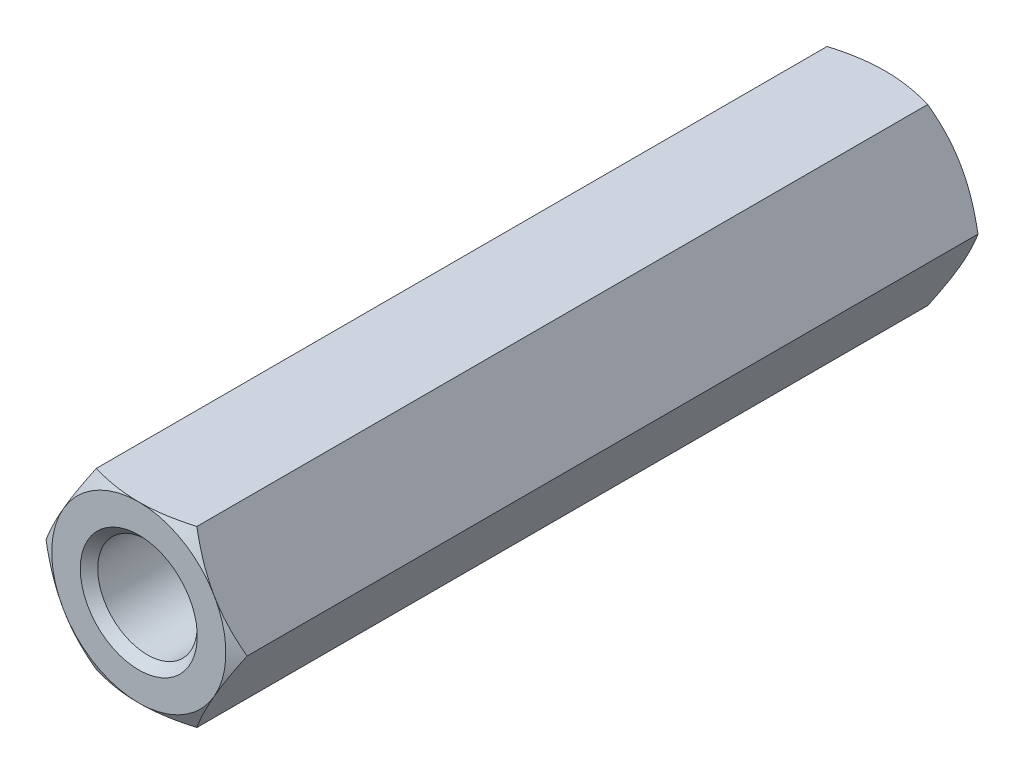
ISO-10303-21;
HEADER;
FILE_DESCRIPTION(('STEP AP214'),'2;1');
FILE_NAME('part.step','',(''),(''),'','','');
FILE_SCHEMA(('AUTOMOTIVE_DESIGN { 1 0 10303 214 1 1 1 1 }'));
ENDSEC;
DATA;
#1=APPLICATION_CONTEXT('core data for automotive mechanical design processes');
#2=APPLICATION_PROTOCOL_DEFINITION('international standard','automotive_design',2000,#1);
#3=PRODUCT_CONTEXT('',#1,'mechanical');
#4=PRODUCT('Part','Part','',(#3));
#5=PRODUCT_RELATED_PRODUCT_CATEGORY('part','',(#4));
#6=PRODUCT_DEFINITION_FORMATION('','',#4);
#7=PRODUCT_DEFINITION_CONTEXT('part definition',#1,'design');
#8=PRODUCT_DEFINITION('design','',#6,#7);
#9=PRODUCT_DEFINITION_SHAPE('','',#8);
#10=(LENGTH_UNIT() NAMED_UNIT(*) SI_UNIT(.MILLI.,.METRE.));
#11=(NAMED_UNIT(*) PLANE_ANGLE_UNIT() SI_UNIT($,.RADIAN.));
#12=(NAMED_UNIT(*) SI_UNIT($,.STERADIAN.) SOLID_ANGLE_UNIT());
#13=UNCERTAINTY_MEASURE_WITH_UNIT(LENGTH_MEASURE(1.E-05),#10,'distance_accuracy_value','');
#14=(GEOMETRIC_REPRESENTATION_CONTEXT(3) GLOBAL_UNCERTAINTY_ASSIGNED_CONTEXT((#13)) GLOBAL_UNIT_ASSIGNED_CONTEXT((#10,
#11,#12)) REPRESENTATION_CONTEXT('',''));
#15=CARTESIAN_POINT('',(0.,0.,0.));
#16=DIRECTION('',(0.,0.,1.));
#17=DIRECTION('',(1.,0.,0.));
#18=AXIS2_PLACEMENT_3D('',#15,#16,#17);
#19=CARTESIAN_POINT('',(4.04145188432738,0.,-15.));
#20=DIRECTION('',(0.866025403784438,0.5,0.));
#21=DIRECTION('',(-0.5,0.866025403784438,0.));
#22=AXIS2_PLACEMENT_3D('',#19,#20,#21);
#23=PLANE('',#22);
#24=CARTESIAN_POINT('',(4.04156735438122,-0.00019999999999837,14.6873259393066));
#25=CARTESIAN_POINT('',(3.9527667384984,0.153607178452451,14.73861421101));
#26=CARTESIAN_POINT('',(3.86319960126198,0.308742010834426,14.7852590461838));
#27=CARTESIAN_POINT('',(3.68251437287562,0.621698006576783,14.8666781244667));
#28=CARTESIAN_POINT('',(3.59139307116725,0.779524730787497,14.9014235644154));
#29=CARTESIAN_POINT('',(3.41027974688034,1.09322221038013,14.9555099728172));
#30=CARTESIAN_POINT('',(3.32031559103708,1.24904469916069,14.9752109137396));
#31=CARTESIAN_POINT('',(3.13996396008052,1.56142288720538,14.9987298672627));
#32=CARTESIAN_POINT('',(3.04957714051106,1.71797745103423,15.0025673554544));
#33=CARTESIAN_POINT('',(2.88068384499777,2.01050921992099,14.994584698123));
#34=CARTESIAN_POINT('',(2.80215208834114,2.14653021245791,14.9847245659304));
#35=CARTESIAN_POINT('',(2.64560020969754,2.417686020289,14.9534735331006));
#36=CARTESIAN_POINT('',(2.5675806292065,2.55281989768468,14.9320719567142));
#37=CARTESIAN_POINT('',(2.41070596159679,2.82453479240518,14.8785695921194));
#38=CARTESIAN_POINT('',(2.33187072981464,2.96108141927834,14.8462420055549));
#39=CARTESIAN_POINT('',(2.17537608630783,3.2321380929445,14.772871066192));
#40=CARTESIAN_POINT('',(2.09771466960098,3.36665161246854,14.7318449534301));
#41=CARTESIAN_POINT('',(2.02061047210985,3.5002,14.6873259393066));
#42=B_SPLINE_CURVE_WITH_KNOTS('',3,(#24,#25,#26,#27,#28,#29,#30,#31,#32,#33,#34,#35,#36,#37,#38,
#39,#40,#41),.UNSPECIFIED.,.F.,.F.,(4,2,2,2,2,2,2,2,4),(0.,0.554793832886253,1.11092123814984,
1.65328467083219,2.19498204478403,2.6666513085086,3.13875761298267,3.62133612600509,
4.10296698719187),.UNSPECIFIED.);
#43=CARTESIAN_POINT('',(4.04145188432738,0.,14.6873926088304));
#44=VERTEX_POINT('',#43);
#45=CARTESIAN_POINT('',(3.03108891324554,1.75,15.));
#46=VERTEX_POINT('',#45);
#47=EDGE_CURVE('E159',#44,#46,#42,.T.);
#48=ORIENTED_EDGE('',*,*,#47,.F.);
#49=DIRECTION('',(0.,0.,1.));
#50=VECTOR('',#49,1.);
#51=CARTESIAN_POINT('',(4.04145188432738,0.,-15.));
#52=LINE('',#51,#50);
#53=CARTESIAN_POINT('',(4.04145188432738,0.,-14.6873926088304));
#54=VERTEX_POINT('',#53);
#55=EDGE_CURVE('E293',#54,#44,#52,.T.);
#56=ORIENTED_EDGE('',*,*,#55,.F.);
#57=CARTESIAN_POINT('',(4.04156735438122,-0.00019999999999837,-14.6873259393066));
#58=CARTESIAN_POINT('',(3.9527667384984,0.153607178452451,-14.73861421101));
#59=CARTESIAN_POINT('',(3.86319960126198,0.308742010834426,-14.7852590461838));
#60=CARTESIAN_POINT('',(3.68251437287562,0.621698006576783,-14.8666781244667));
#61=CARTESIAN_POINT('',(3.59139307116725,0.779524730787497,-14.9014235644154));
#62=CARTESIAN_POINT('',(3.41027974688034,1.09322221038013,-14.9555099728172));
#63=CARTESIAN_POINT('',(3.32031559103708,1.24904469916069,-14.9752109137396));
#64=CARTESIAN_POINT('',(3.13996396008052,1.56142288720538,-14.9987298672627));
#65=CARTESIAN_POINT('',(3.04957714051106,1.71797745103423,-15.0025673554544));
#66=CARTESIAN_POINT('',(2.88068384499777,2.01050921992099,-14.994584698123));
#67=CARTESIAN_POINT('',(2.80215208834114,2.14653021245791,-14.9847245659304));
#68=CARTESIAN_POINT('',(2.64560020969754,2.417686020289,-14.9534735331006));
#69=CARTESIAN_POINT('',(2.5675806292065,2.55281989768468,-14.9320719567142));
#70=CARTESIAN_POINT('',(2.41070596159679,2.82453479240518,-14.8785695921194));
#71=CARTESIAN_POINT('',(2.33187072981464,2.96108141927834,-14.8462420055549));
#72=CARTESIAN_POINT('',(2.17537608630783,3.2321380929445,-14.772871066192));
#73=CARTESIAN_POINT('',(2.09771466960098,3.36665161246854,-14.7318449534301));
#74=CARTESIAN_POINT('',(2.02061047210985,3.5002,-14.6873259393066));
#75=B_SPLINE_CURVE_WITH_KNOTS('',3,(#57,#58,#59,#60,#61,#62,#63,#64,#65,#66,#67,#68,#69,#70,#71,
#72,#73,#74),.UNSPECIFIED.,.F.,.F.,(4,2,2,2,2,2,2,2,4),(0.,0.554793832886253,1.11092123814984,
1.65328467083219,2.19498204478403,2.6666513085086,3.13875761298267,3.62133612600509,
4.10296698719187),.UNSPECIFIED.);
#76=CARTESIAN_POINT('',(3.03108891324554,1.75,-15.));
#77=VERTEX_POINT('',#76);
#78=EDGE_CURVE('E284',#54,#77,#75,.T.);
#79=ORIENTED_EDGE('',*,*,#78,.T.);
#80=CARTESIAN_POINT('',(2.02072594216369,3.5,-14.6873926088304));
#81=VERTEX_POINT('',#80);
#82=EDGE_CURVE('E235',#77,#81,#75,.T.);
#83=ORIENTED_EDGE('',*,*,#82,.T.);
#84=DIRECTION('',(0.,0.,1.));
#85=VECTOR('',#84,1.);
#86=CARTESIAN_POINT('',(2.02072594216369,3.5,-15.));
#87=LINE('',#86,#85);
#88=CARTESIAN_POINT('',(2.02072594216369,3.5,14.6873926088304));
#89=VERTEX_POINT('',#88);
#90=EDGE_CURVE('E317',#81,#89,#87,.T.);
#91=ORIENTED_EDGE('',*,*,#90,.T.);
#92=EDGE_CURVE('E138',#46,#89,#42,.T.);
#93=ORIENTED_EDGE('',*,*,#92,.F.);
#94=EDGE_LOOP('',(#48,#56,#79,#83,#91,#93));
#95=FACE_BOUND('',#94,.T.);
#96=ADVANCED_FACE('F34',(#95),#23,.T.);
#97=CARTESIAN_POINT('',(2.02072594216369,-3.5,-15.));
#98=DIRECTION('',(0.866025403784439,-0.5,0.));
#99=DIRECTION('',(0.5,0.866025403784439,0.));
#100=AXIS2_PLACEMENT_3D('',#97,#98,#99);
#101=PLANE('',#100);
#102=CARTESIAN_POINT('',(2.02061047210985,-3.5002,14.6873259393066));
#103=CARTESIAN_POINT('',(2.10941108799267,-3.34639282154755,14.73861421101));
#104=CARTESIAN_POINT('',(2.19897822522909,-3.19125798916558,14.7852590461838));
#105=CARTESIAN_POINT('',(2.37966345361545,-2.87830199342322,14.8666781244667));
#106=CARTESIAN_POINT('',(2.47078475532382,-2.7204752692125,14.9014235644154));
#107=CARTESIAN_POINT('',(2.65189807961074,-2.40677778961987,14.9555099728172));
#108=CARTESIAN_POINT('',(2.74186223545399,-2.25095530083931,14.9752109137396));
#109=CARTESIAN_POINT('',(2.92221386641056,-1.93857711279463,14.9987298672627));
#110=CARTESIAN_POINT('',(3.01260068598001,-1.78202254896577,15.0025673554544));
#111=CARTESIAN_POINT('',(3.1814939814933,-1.48949078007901,14.994584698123));
#112=CARTESIAN_POINT('',(3.26002573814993,-1.35346978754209,14.9847245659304));
#113=CARTESIAN_POINT('',(3.41657761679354,-1.082313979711,14.9534735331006));
#114=CARTESIAN_POINT('',(3.49459719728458,-0.947180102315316,14.9320719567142));
#115=CARTESIAN_POINT('',(3.65147186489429,-0.675465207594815,14.8785695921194));
#116=CARTESIAN_POINT('',(3.73030709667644,-0.538918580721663,14.8462420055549));
#117=CARTESIAN_POINT('',(3.88680174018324,-0.267861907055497,14.772871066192));
#118=CARTESIAN_POINT('',(3.96446315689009,-0.133348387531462,14.7318449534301));
#119=CARTESIAN_POINT('',(4.04156735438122,0.0002000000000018,14.6873259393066));
#120=B_SPLINE_CURVE_WITH_KNOTS('',3,(#102,#103,#104,#105,#106,#107,#108,#109,#110,#111,#112,
#113,#114,#115,#116,#117,#118,#119),.UNSPECIFIED.,.F.,.F.,(4,2,2,2,2,2,2,2,4),(0.,
0.554793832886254,1.11092123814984,1.65328467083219,2.19498204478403,2.6666513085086,
3.13875761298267,3.6213361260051,4.10296698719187),.UNSPECIFIED.);
#121=CARTESIAN_POINT('',(2.02072594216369,-3.5,14.6873926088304));
#122=VERTEX_POINT('',#121);
#123=CARTESIAN_POINT('',(3.03108891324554,-1.75,15.));
#124=VERTEX_POINT('',#123);
#125=EDGE_CURVE('E365',#122,#124,#120,.T.);
#126=ORIENTED_EDGE('',*,*,#125,.F.);
#127=DIRECTION('',(0.,0.,1.));
#128=VECTOR('',#127,1.);
#129=CARTESIAN_POINT('',(2.02072594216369,-3.5,-15.));
#130=LINE('',#129,#128);
#131=CARTESIAN_POINT('',(2.02072594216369,-3.5,-14.6873926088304));
#132=VERTEX_POINT('',#131);
#133=EDGE_CURVE('E367',#132,#122,#130,.T.);
#134=ORIENTED_EDGE('',*,*,#133,.F.);
#135=CARTESIAN_POINT('',(2.02061047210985,-3.5002,-14.6873259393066));
#136=CARTESIAN_POINT('',(2.10941108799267,-3.34639282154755,-14.73861421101));
#137=CARTESIAN_POINT('',(2.19897822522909,-3.19125798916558,-14.7852590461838));
#138=CARTESIAN_POINT('',(2.37966345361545,-2.87830199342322,-14.8666781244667));
#139=CARTESIAN_POINT('',(2.47078475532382,-2.7204752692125,-14.9014235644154));
#140=CARTESIAN_POINT('',(2.65189807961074,-2.40677778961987,-14.9555099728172));
#141=CARTESIAN_POINT('',(2.74186223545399,-2.25095530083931,-14.9752109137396));
#142=CARTESIAN_POINT('',(2.92221386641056,-1.93857711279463,-14.9987298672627));
#143=CARTESIAN_POINT('',(3.01260068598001,-1.78202254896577,-15.0025673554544));
#144=CARTESIAN_POINT('',(3.1814939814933,-1.48949078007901,-14.994584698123));
#145=CARTESIAN_POINT('',(3.26002573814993,-1.35346978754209,-14.9847245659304));
#146=CARTESIAN_POINT('',(3.41657761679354,-1.082313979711,-14.9534735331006));
#147=CARTESIAN_POINT('',(3.49459719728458,-0.947180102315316,-14.9320719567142));
#148=CARTESIAN_POINT('',(3.65147186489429,-0.675465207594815,-14.8785695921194));
#149=CARTESIAN_POINT('',(3.73030709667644,-0.538918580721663,-14.8462420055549));
#150=CARTESIAN_POINT('',(3.88680174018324,-0.267861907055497,-14.772871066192));
#151=CARTESIAN_POINT('',(3.96446315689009,-0.133348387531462,-14.7318449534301));
#152=CARTESIAN_POINT('',(4.04156735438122,0.0002000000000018,-14.6873259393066));
#153=B_SPLINE_CURVE_WITH_KNOTS('',3,(#135,#136,#137,#138,#139,#140,#141,#142,#143,#144,#145,
#146,#147,#148,#149,#150,#151,#152),.UNSPECIFIED.,.F.,.F.,(4,2,2,2,2,2,2,2,4),(0.,
0.554793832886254,1.11092123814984,1.65328467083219,2.19498204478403,2.6666513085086,
3.13875761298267,3.6213361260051,4.10296698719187),.UNSPECIFIED.);
#154=CARTESIAN_POINT('',(3.03108891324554,-1.75,-15.));
#155=VERTEX_POINT('',#154);
#156=EDGE_CURVE('E308',#132,#155,#153,.T.);
#157=ORIENTED_EDGE('',*,*,#156,.T.);
#158=EDGE_CURVE('E232',#155,#54,#153,.T.);
#159=ORIENTED_EDGE('',*,*,#158,.T.);
#160=ORIENTED_EDGE('',*,*,#55,.T.);
#161=EDGE_CURVE('E160',#124,#44,#120,.T.);
#162=ORIENTED_EDGE('',*,*,#161,.F.);
#163=EDGE_LOOP('',(#126,#134,#157,#159,#160,#162));
#164=FACE_BOUND('',#163,.T.);
#165=ADVANCED_FACE('F305',(#164),#101,.T.);
#166=CARTESIAN_POINT('',(-2.02072594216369,-3.5,-15.));
#167=DIRECTION('',(0.,-1.,0.));
#168=DIRECTION('',(1.,0.,0.));
#169=AXIS2_PLACEMENT_3D('',#166,#167,#168);
#170=PLANE('',#169);
#171=CARTESIAN_POINT('',(-24.0144010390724,-3.50000000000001,3.00952260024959));
#172=CARTESIAN_POINT('',(-23.5019774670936,-3.50000000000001,3.3022760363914));
#173=CARTESIAN_POINT('',(-22.9894717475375,-3.50000000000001,3.59488557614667));
#174=CARTESIAN_POINT('',(-21.9642551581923,-3.50000000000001,4.17974590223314));
#175=CARTESIAN_POINT('',(-21.451544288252,-3.50000000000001,4.47199668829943));
#176=CARTESIAN_POINT('',(-19.9129889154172,-3.50000000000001,5.34813508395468));
#177=CARTESIAN_POINT('',(-18.8867764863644,-3.50000000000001,5.93137738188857));
#178=CARTESIAN_POINT('',(-17.3463207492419,-3.50000000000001,6.8041501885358));
#179=CARTESIAN_POINT('',(-16.8326640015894,-3.50000000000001,7.09471587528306));
#180=CARTESIAN_POINT('',(-15.8048376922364,-3.50000000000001,7.67493868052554));
#181=CARTESIAN_POINT('',(-15.2906681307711,-3.50000000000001,7.96459579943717));
#182=CARTESIAN_POINT('',(-14.2616693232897,-3.5,8.54269277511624));
#183=CARTESIAN_POINT('',(-13.7468401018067,-3.5,8.83113267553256));
#184=CARTESIAN_POINT('',(-12.7162585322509,-3.5,9.406357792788));
#185=CARTESIAN_POINT('',(-12.2005061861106,-3.5,9.69314301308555));
#186=CARTESIAN_POINT('',(-11.1655889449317,-3.5,10.2655250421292));
#187=CARTESIAN_POINT('',(-10.6464187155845,-3.5,10.5511122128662));
#188=CARTESIAN_POINT('',(-9.60611844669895,-3.5,11.1187962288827));
#189=CARTESIAN_POINT('',(-9.08498827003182,-3.5,11.4008928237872));
#190=CARTESIAN_POINT('',(-8.30089317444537,-3.5,11.8199184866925));
#191=CARTESIAN_POINT('',(-8.03905112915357,-3.5,11.9589472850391));
#192=CARTESIAN_POINT('',(-7.5144024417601,-3.5,12.2351713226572));
#193=CARTESIAN_POINT('',(-7.25159580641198,-3.5,12.3723665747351));
#194=CARTESIAN_POINT('',(-6.72476823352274,-3.5,12.644327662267));
#195=CARTESIAN_POINT('',(-6.46074745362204,-3.5,12.7790938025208));
#196=CARTESIAN_POINT('',(-5.93106751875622,-3.5,13.0453619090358));
#197=CARTESIAN_POINT('',(-5.66540840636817,-3.5,13.1768639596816));
#198=CARTESIAN_POINT('',(-5.12712536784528,-3.5,13.4376375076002));
#199=CARTESIAN_POINT('',(-4.85446174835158,-3.5,13.5668273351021));
#200=CARTESIAN_POINT('',(-4.30593256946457,-3.5,13.8184789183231));
#201=CARTESIAN_POINT('',(-4.03006629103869,-3.5,13.9409391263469));
#202=CARTESIAN_POINT('',(-3.61288240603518,-3.5,14.1170497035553));
#203=CARTESIAN_POINT('',(-3.47317951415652,-3.5,14.1745193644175));
#204=CARTESIAN_POINT('',(-3.19250774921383,-3.5,14.2862698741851));
#205=CARTESIAN_POINT('',(-3.05153895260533,-3.5,14.3405509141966));
#206=CARTESIAN_POINT('',(-2.76815876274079,-3.5,14.4451459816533));
#207=CARTESIAN_POINT('',(-2.62574765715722,-3.5,14.4954607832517));
#208=CARTESIAN_POINT('',(-2.33928161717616,-3.5,14.5911444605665));
#209=CARTESIAN_POINT('',(-2.19522685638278,-3.5,14.6365138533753));
#210=CARTESIAN_POINT('',(-1.85681791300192,-3.5,14.7352735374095));
#211=CARTESIAN_POINT('',(-1.66175187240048,-3.5,14.7862728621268));
#212=CARTESIAN_POINT('',(-1.26837086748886,-3.5,14.8739455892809));
#213=CARTESIAN_POINT('',(-1.07005688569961,-3.5,14.9106232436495));
#214=CARTESIAN_POINT('',(-0.771524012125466,-3.5,14.9522334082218));
#215=CARTESIAN_POINT('',(-0.672219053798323,-3.5,14.963849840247));
#216=CARTESIAN_POINT('',(-0.473177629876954,-3.5,14.982404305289));
#217=CARTESIAN_POINT('',(-0.373441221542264,-3.5,14.9893429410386));
#218=CARTESIAN_POINT('',(-0.173751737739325,-3.5,14.998327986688));
#219=CARTESIAN_POINT('',(-0.0737986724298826,-3.5,15.0003746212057));
#220=CARTESIAN_POINT('',(0.126085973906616,-3.5,14.9995126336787));
#221=CARTESIAN_POINT('',(0.226017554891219,-3.5,14.9966040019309));
#222=CARTESIAN_POINT('',(0.425499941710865,-3.5,14.9859286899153));
#223=CARTESIAN_POINT('',(0.52505105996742,-3.5,14.9781678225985));
#224=CARTESIAN_POINT('',(0.723689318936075,-3.5,14.9580291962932));
#225=CARTESIAN_POINT('',(0.822776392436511,-3.5,14.9456507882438));
#226=CARTESIAN_POINT('',(1.11911457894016,-3.5,14.9020808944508));
#227=CARTESIAN_POINT('',(1.31544487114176,-3.5,14.8644546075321));
#228=CARTESIAN_POINT('',(1.60840867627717,-3.5,14.7974553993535));
#229=CARTESIAN_POINT('',(1.70628490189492,-3.5,14.7732168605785));
#230=CARTESIAN_POINT('',(1.90122897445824,-3.5,14.7216554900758));
#231=CARTESIAN_POINT('',(1.99829681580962,-3.5,14.6943326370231));
#232=CARTESIAN_POINT('',(2.19162035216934,-3.5,14.6370093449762));
#233=CARTESIAN_POINT('',(2.28787613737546,-3.5,14.6070092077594));
#234=CARTESIAN_POINT('',(2.47962532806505,-3.5,14.5446890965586));
#235=CARTESIAN_POINT('',(2.57511877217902,-3.5,14.5123692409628));
#236=CARTESIAN_POINT('',(2.89221812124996,-3.5,14.4013318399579));
#237=CARTESIAN_POINT('',(3.11227583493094,-3.5,14.3181871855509));
#238=CARTESIAN_POINT('',(3.54935112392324,-3.5,14.1442183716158));
#239=CARTESIAN_POINT('',(3.76636785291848,-3.5,14.0533921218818));
#240=CARTESIAN_POINT('',(4.19818544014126,-3.5,13.8661289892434));
#241=CARTESIAN_POINT('',(4.41298414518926,-3.5,13.7696871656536));
#242=CARTESIAN_POINT('',(4.84067925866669,-3.5,13.5727526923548));
#243=CARTESIAN_POINT('',(5.05357586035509,-3.5,13.4722604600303));
#244=CARTESIAN_POINT('',(5.47844229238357,-3.5,13.2679722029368));
#245=CARTESIAN_POINT('',(5.69040837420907,-3.5,13.1641684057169));
#246=CARTESIAN_POINT('',(6.11318158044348,-3.5,12.954221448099));
#247=CARTESIAN_POINT('',(6.32398868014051,-3.5,12.8480782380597));
#248=CARTESIAN_POINT('',(6.74456880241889,-3.5,12.6340279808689));
#249=CARTESIAN_POINT('',(6.95434229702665,-3.5,12.5261218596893));
#250=CARTESIAN_POINT('',(7.37314220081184,-3.5,12.3088683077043));
#251=CARTESIAN_POINT('',(7.58216860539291,-3.5,12.1995208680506));
#252=CARTESIAN_POINT('',(8.20902498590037,-3.5,11.8693980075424));
#253=CARTESIAN_POINT('',(8.62594454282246,-3.5,11.6468945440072));
#254=CARTESIAN_POINT('',(9.45817666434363,-3.5,11.1987926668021));
#255=CARTESIAN_POINT('',(9.87348902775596,-3.5,10.9731938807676));
#256=CARTESIAN_POINT('',(10.7023110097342,-3.5,10.5201698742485));
#257=CARTESIAN_POINT('',(11.1158223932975,-3.5,10.2927478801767));
#258=CARTESIAN_POINT('',(11.9419778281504,-3.5,9.83633359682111));
#259=CARTESIAN_POINT('',(12.3546218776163,-3.5,9.60734130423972));
#260=CARTESIAN_POINT('',(13.2390358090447,-3.5,9.11489542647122));
#261=CARTESIAN_POINT('',(13.7107038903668,-3.5,8.85125909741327));
#262=CARTESIAN_POINT('',(14.6534040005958,-3.5,8.32284151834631));
#263=CARTESIAN_POINT('',(15.1244360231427,-3.5,8.05806025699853));
#264=CARTESIAN_POINT('',(16.5372790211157,-3.5,7.26216349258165));
#265=CARTESIAN_POINT('',(17.4783638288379,-3.5,6.72975925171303));
#266=CARTESIAN_POINT('',(19.3526150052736,-3.49999999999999,5.66667015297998));
#267=CARTESIAN_POINT('',(20.2857898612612,-3.49999999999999,5.13600023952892));
#268=CARTESIAN_POINT('',(21.6847186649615,-3.49999999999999,4.33909452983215));
#269=CARTESIAN_POINT('',(22.1507686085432,-3.49999999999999,4.07337817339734));
#270=CARTESIAN_POINT('',(23.0827018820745,-3.49999999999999,3.54165477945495));
#271=CARTESIAN_POINT('',(23.5485852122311,-3.49999999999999,3.27564774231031));
#272=CARTESIAN_POINT('',(24.0144010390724,-3.49999999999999,3.0095226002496));
#273=B_SPLINE_CURVE_WITH_KNOTS('',3,(#171,#172,#173,#174,#175,#176,#177,#178,#179,#180,#181,
#182,#183,#184,#185,#186,#187,#188,#189,#190,#191,#192,#193,#194,#195,#196,#197,#198,#199,#200,
#201,#202,#203,#204,#205,#206,#207,#208,#209,#210,#211,#212,#213,#214,#215,#216,#217,#218,#219,
#220,#221,#222,#223,#224,#225,#226,#227,#228,#229,#230,#231,#232,#233,#234,#235,#236,#237,#238,
#239,#240,#241,#242,#243,#244,#245,#246,#247,#248,#249,#250,#251,#252,#253,#254,#255,#256,#257,
#258,#259,#260,#261,#262,#263,#264,#265,#266,#267,#268,#269,#270,#271,#272),.UNSPECIFIED.,.F.,
.F.,(4,2,2,2,2,2,2,2,2,2,2,2,2,2,2,2,2,2,2,2,2,2,2,2,2,2,2,2,2,2,2,2,2,2,2,2,2,2,2,2,2,2,2,2,2,
2,2,2,2,2,4),(0.,1.77046373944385,3.5409287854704,7.08204837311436,8.85248413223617,
10.6229190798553,12.3932899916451,14.1636572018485,15.9412552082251,17.7189799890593,
18.6083635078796,19.4977408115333,20.3870057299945,21.2762476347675,22.181356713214,
23.0866730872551,23.5398284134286,23.9929565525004,24.4459960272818,24.8989880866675,
25.5034565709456,26.1077454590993,26.4075978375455,26.7074115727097,27.0072115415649,
27.3070120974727,27.6064541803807,27.9059383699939,28.5049001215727,28.8073671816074,
29.1098363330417,29.412271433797,29.714691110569,30.420177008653,31.1258554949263,
31.8321645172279,32.5384009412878,33.2464385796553,33.9544912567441,34.6621832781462,
35.3698796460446,36.7875902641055,38.2054729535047,39.6212406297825,41.0370112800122,
42.6580500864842,44.2791049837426,47.5228404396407,50.7433720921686,52.3528034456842,
53.962232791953),.UNSPECIFIED.);
#274=CARTESIAN_POINT('',(-2.02072594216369,-3.5,14.6873926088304));
#275=VERTEX_POINT('',#274);
#276=CARTESIAN_POINT('',(0.,-3.5,15.));
#277=VERTEX_POINT('',#276);
#278=EDGE_CURVE('E360',#275,#277,#273,.T.);
#279=ORIENTED_EDGE('',*,*,#278,.F.);
#280=DIRECTION('',(0.,0.,1.));
#281=VECTOR('',#280,1.);
#282=CARTESIAN_POINT('',(-2.02072594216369,-3.5,-15.));
#283=LINE('',#282,#281);
#284=CARTESIAN_POINT('',(-2.02072594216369,-3.5,-14.6873926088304));
#285=VERTEX_POINT('',#284);
#286=EDGE_CURVE('E368',#285,#275,#283,.T.);
#287=ORIENTED_EDGE('',*,*,#286,.F.);
#288=CARTESIAN_POINT('',(-13.93909338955,-3.50000000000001,-8.72316958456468));
#289=CARTESIAN_POINT('',(-13.6340370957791,-3.50000000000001,-8.8939836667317));
#290=CARTESIAN_POINT('',(-13.328844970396,-3.5,-9.06455582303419));
#291=CARTESIAN_POINT('',(-12.7181143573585,-3.5,-9.40508295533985));
#292=CARTESIAN_POINT('',(-12.412575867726,-3.5,-9.57503792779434));
#293=CARTESIAN_POINT('',(-11.8010010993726,-3.5,-9.91423989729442));
#294=CARTESIAN_POINT('',(-11.4949647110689,-3.5,-10.0834866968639));
#295=CARTESIAN_POINT('',(-10.8823730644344,-3.5,-10.4210373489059));
#296=CARTESIAN_POINT('',(-10.5758178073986,-3.5,-10.589341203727));
#297=CARTESIAN_POINT('',(-9.96272869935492,-3.5,-10.9243828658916));
#298=CARTESIAN_POINT('',(-9.65619628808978,-3.5,-11.0911233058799));
#299=CARTESIAN_POINT('',(-9.04229742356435,-3.5,-11.4230613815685));
#300=CARTESIAN_POINT('',(-8.73493097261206,-3.5,-11.5882590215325));
#301=CARTESIAN_POINT('',(-8.11914738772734,-3.5,-11.9165906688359));
#302=CARTESIAN_POINT('',(-7.8107303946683,-3.5,-12.079724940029));
#303=CARTESIAN_POINT('',(-7.19244579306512,-3.5,-12.4032177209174));
#304=CARTESIAN_POINT('',(-6.88257820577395,-3.5,-12.5635762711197));
#305=CARTESIAN_POINT('',(-6.26306488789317,-3.5,-12.8792724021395));
#306=CARTESIAN_POINT('',(-5.95343325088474,-3.5,-13.0346375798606));
#307=CARTESIAN_POINT('',(-5.33137168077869,-3.5,-13.3398544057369));
#308=CARTESIAN_POINT('',(-5.01894126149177,-3.5,-13.489705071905));
#309=CARTESIAN_POINT('',(-4.54653144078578,-3.5,-13.7085181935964));
#310=CARTESIAN_POINT('',(-4.38801795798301,-3.5,-13.7806413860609));
#311=CARTESIAN_POINT('',(-4.06979128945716,-3.5,-13.92218453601));
#312=CARTESIAN_POINT('',(-3.91007814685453,-3.5,-13.9916045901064));
#313=CARTESIAN_POINT('',(-3.58923189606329,-3.5,-14.1270199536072));
#314=CARTESIAN_POINT('',(-3.42809904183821,-3.5,-14.1930158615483));
#315=CARTESIAN_POINT('',(-3.10411792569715,-3.5,-14.3206318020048));
#316=CARTESIAN_POINT('',(-2.94126979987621,-3.5,-14.3822521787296));
#317=CARTESIAN_POINT('',(-2.57330185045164,-3.5,-14.5143159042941));
#318=CARTESIAN_POINT('',(-2.36761759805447,-3.5,-14.5832123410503));
#319=CARTESIAN_POINT('',(-1.95256058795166,-3.5,-14.7090662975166));
#320=CARTESIAN_POINT('',(-1.74318771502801,-3.5,-14.7660234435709));
#321=CARTESIAN_POINT('',(-1.32302041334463,-3.5,-14.8632625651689));
#322=CARTESIAN_POINT('',(-1.11227086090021,-3.5,-14.9037308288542));
#323=CARTESIAN_POINT('',(-0.794049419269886,-3.5,-14.9495004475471));
#324=CARTESIAN_POINT('',(-0.687633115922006,-3.5,-14.9622678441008));
#325=CARTESIAN_POINT('',(-0.47429919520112,-3.5,-14.9824338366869));
#326=CARTESIAN_POINT('',(-0.367381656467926,-3.5,-14.9898332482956));
#327=CARTESIAN_POINT('',(-0.151941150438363,-3.5,-14.9990600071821));
#328=CARTESIAN_POINT('',(-0.0434150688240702,-3.5,-15.0008152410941));
#329=CARTESIAN_POINT('',(0.173574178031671,-3.5,-14.9984861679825));
#330=CARTESIAN_POINT('',(0.282037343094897,-3.5,-14.9944018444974));
#331=CARTESIAN_POINT('',(0.498618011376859,-3.5,-14.980543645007));
#332=CARTESIAN_POINT('',(0.606735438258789,-3.5,-14.9707685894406));
#333=CARTESIAN_POINT('',(0.822348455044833,-3.5,-14.9458689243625));
#334=CARTESIAN_POINT('',(0.929844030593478,-3.5,-14.9307441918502));
#335=CARTESIAN_POINT('',(1.14527612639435,-3.5,-14.8954132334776));
#336=CARTESIAN_POINT('',(1.25320318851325,-3.5,-14.8751498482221));
#337=CARTESIAN_POINT('',(1.46812360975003,-3.5,-14.8301893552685));
#338=CARTESIAN_POINT('',(1.57511695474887,-3.5,-14.8054921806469));
#339=CARTESIAN_POINT('',(1.78815137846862,-3.5,-14.7522271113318));
#340=CARTESIAN_POINT('',(1.89419226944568,-3.5,-14.7236584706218));
#341=CARTESIAN_POINT('',(2.10530694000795,-3.5,-14.6631901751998));
#342=CARTESIAN_POINT('',(2.21038077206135,-3.5,-14.6312907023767));
#343=CARTESIAN_POINT('',(2.51184829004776,-3.5,-14.5352775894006));
#344=CARTESIAN_POINT('',(2.70709295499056,-3.5,-14.4675545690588));
#345=CARTESIAN_POINT('',(3.09486410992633,-3.5,-14.3246844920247));
#346=CARTESIAN_POINT('',(3.28738980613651,-3.5,-14.2495353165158));
#347=CARTESIAN_POINT('',(3.67037650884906,-3.5,-14.0936562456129));
#348=CARTESIAN_POINT('',(3.86083529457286,-3.5,-14.0129209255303));
#349=CARTESIAN_POINT('',(4.23991407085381,-3.5,-13.8473190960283));
#350=CARTESIAN_POINT('',(4.42853424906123,-3.5,-13.7624530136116));
#351=CARTESIAN_POINT('',(4.80483432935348,-3.5,-13.589327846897));
#352=CARTESIAN_POINT('',(4.99251022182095,-3.5,-13.5010600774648));
#353=CARTESIAN_POINT('',(5.3666844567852,-3.5,-13.3220606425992));
#354=CARTESIAN_POINT('',(5.55318277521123,-3.5,-13.2313289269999));
#355=CARTESIAN_POINT('',(6.11104952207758,-3.5,-12.956362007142));
#356=CARTESIAN_POINT('',(6.48100139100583,-3.5,-12.7692560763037));
#357=CARTESIAN_POINT('',(7.21924313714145,-3.5,-12.3896905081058));
#358=CARTESIAN_POINT('',(7.58752697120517,-3.5,-12.1972191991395));
#359=CARTESIAN_POINT('',(8.32236027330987,-3.5,-11.8088866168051));
#360=CARTESIAN_POINT('',(8.6889095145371,-3.5,-11.6130249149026));
#361=CARTESIAN_POINT('',(9.42018483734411,-3.5,-11.2192150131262));
#362=CARTESIAN_POINT('',(9.78491281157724,-3.5,-11.0212703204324));
#363=CARTESIAN_POINT('',(10.5134214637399,-3.5,-10.6236447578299));
#364=CARTESIAN_POINT('',(10.8772021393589,-3.5,-10.4239638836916));
#365=CARTESIAN_POINT('',(11.4663032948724,-3.5,-10.099222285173));
#366=CARTESIAN_POINT('',(11.6918455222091,-3.5,-9.97456335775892));
#367=CARTESIAN_POINT('',(12.1427515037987,-3.5,-9.72478250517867));
#368=CARTESIAN_POINT('',(12.368115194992,-3.5,-9.59966046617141));
#369=CARTESIAN_POINT('',(12.8178779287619,-3.5,-9.34947273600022));
#370=CARTESIAN_POINT('',(13.0422776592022,-3.5,-9.22440828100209));
#371=CARTESIAN_POINT('',(13.4908410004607,-3.5,-8.9739969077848));
#372=CARTESIAN_POINT('',(13.7150046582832,-3.5,-8.84865007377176));
#373=CARTESIAN_POINT('',(13.93909338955,-3.5,-8.72316958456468));
#374=B_SPLINE_CURVE_WITH_KNOTS('',3,(#288,#289,#290,#291,#292,#293,#294,#295,#296,#297,#298,
#299,#300,#301,#302,#303,#304,#305,#306,#307,#308,#309,#310,#311,#312,#313,#314,#315,#316,#317,
#318,#319,#320,#321,#322,#323,#324,#325,#326,#327,#328,#329,#330,#331,#332,#333,#334,#335,#336,
#337,#338,#339,#340,#341,#342,#343,#344,#345,#346,#347,#348,#349,#350,#351,#352,#353,#354,#355,
#356,#357,#358,#359,#360,#361,#362,#363,#364,#365,#366,#367,#368,#369,#370,#371,#372,#373),
.UNSPECIFIED.,.F.,.F.,(4,2,2,2,2,2,2,2,2,2,2,2,2,2,2,2,2,2,2,2,2,2,2,2,2,2,2,2,2,2,2,2,2,2,2,2,
2,2,2,2,2,2,4),(0.,1.04887173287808,2.09774948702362,3.14690246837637,4.19605283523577,
5.24289261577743,6.2897295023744,7.33643114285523,8.383117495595,9.4223602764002,
10.4617872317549,10.9842185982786,11.5066312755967,12.0289523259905,12.551232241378,
13.2017093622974,13.8522068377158,14.4951364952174,14.8165592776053,15.1379332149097,
15.4633972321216,15.788862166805,16.1143945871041,16.4399344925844,16.7692678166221,
17.0986061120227,17.4280079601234,17.7573918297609,18.3771299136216,18.9970453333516,
19.6175714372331,20.2380335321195,20.8602010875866,21.4823813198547,22.726041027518,
23.9726577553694,25.2194332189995,26.464368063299,27.7093059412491,28.4824046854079,
29.2557081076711,30.0264005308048,30.7968874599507),.UNSPECIFIED.);
#375=CARTESIAN_POINT('',(0.,-3.5,-15.));
#376=VERTEX_POINT('',#375);
#377=EDGE_CURVE('E313',#285,#376,#374,.T.);
#378=ORIENTED_EDGE('',*,*,#377,.T.);
#379=EDGE_CURVE('E260',#376,#132,#374,.T.);
#380=ORIENTED_EDGE('',*,*,#379,.T.);
#381=ORIENTED_EDGE('',*,*,#133,.T.);
#382=EDGE_CURVE('E195',#277,#122,#273,.T.);
#383=ORIENTED_EDGE('',*,*,#382,.F.);
#384=EDGE_LOOP('',(#279,#287,#378,#380,#381,#383));
#385=FACE_BOUND('',#384,.T.);
#386=ADVANCED_FACE('F218',(#385),#170,.T.);
#387=CARTESIAN_POINT('',(-4.04145188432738,0.,-15.));
#388=DIRECTION('',(-0.866025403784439,-0.5,0.));
#389=DIRECTION('',(0.5,-0.866025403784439,0.));
#390=AXIS2_PLACEMENT_3D('',#387,#388,#389);
#391=PLANE('',#390);
#392=CARTESIAN_POINT('',(-4.04156735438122,0.000199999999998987,14.6873259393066));
#393=CARTESIAN_POINT('',(-3.9527667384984,-0.153607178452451,14.73861421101));
#394=CARTESIAN_POINT('',(-3.86319960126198,-0.308742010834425,14.7852590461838));
#395=CARTESIAN_POINT('',(-3.68251437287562,-0.621698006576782,14.8666781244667));
#396=CARTESIAN_POINT('',(-3.59139307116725,-0.779524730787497,14.9014235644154));
#397=CARTESIAN_POINT('',(-3.41027974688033,-1.09322221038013,14.9555099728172));
#398=CARTESIAN_POINT('',(-3.32031559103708,-1.24904469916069,14.9752109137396));
#399=CARTESIAN_POINT('',(-3.13996396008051,-1.56142288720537,14.9987298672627));
#400=CARTESIAN_POINT('',(-3.04957714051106,-1.71797745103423,15.0025673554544));
#401=CARTESIAN_POINT('',(-2.88068384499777,-2.01050921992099,14.994584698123));
#402=CARTESIAN_POINT('',(-2.80215208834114,-2.14653021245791,14.9847245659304));
#403=CARTESIAN_POINT('',(-2.64560020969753,-2.41768602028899,14.9534735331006));
#404=CARTESIAN_POINT('',(-2.56758062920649,-2.55281989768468,14.9320719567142));
#405=CARTESIAN_POINT('',(-2.41070596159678,-2.82453479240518,14.8785695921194));
#406=CARTESIAN_POINT('',(-2.33187072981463,-2.96108141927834,14.8462420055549));
#407=CARTESIAN_POINT('',(-2.17537608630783,-3.2321380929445,14.772871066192));
#408=CARTESIAN_POINT('',(-2.09771466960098,-3.36665161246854,14.7318449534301));
#409=CARTESIAN_POINT('',(-2.02061047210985,-3.5002,14.6873259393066));
#410=B_SPLINE_CURVE_WITH_KNOTS('',3,(#392,#393,#394,#395,#396,#397,#398,#399,#400,#401,#402,
#403,#404,#405,#406,#407,#408,#409),.UNSPECIFIED.,.F.,.F.,(4,2,2,2,2,2,2,2,4),(0.,
0.554793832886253,1.11092123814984,1.65328467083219,2.19498204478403,2.6666513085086,
3.13875761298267,3.6213361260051,4.10296698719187),.UNSPECIFIED.);
#411=CARTESIAN_POINT('',(-4.04145188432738,0.,14.6873926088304));
#412=VERTEX_POINT('',#411);
#413=CARTESIAN_POINT('',(-3.03108891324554,-1.75,15.));
#414=VERTEX_POINT('',#413);
#415=EDGE_CURVE('E147',#412,#414,#410,.T.);
#416=ORIENTED_EDGE('',*,*,#415,.F.);
#417=DIRECTION('',(0.,0.,1.));
#418=VECTOR('',#417,1.);
#419=CARTESIAN_POINT('',(-4.04145188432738,0.,-15.));
#420=LINE('',#419,#418);
#421=CARTESIAN_POINT('',(-4.04145188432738,0.,-14.6873926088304));
#422=VERTEX_POINT('',#421);
#423=EDGE_CURVE('E158',#422,#412,#420,.T.);
#424=ORIENTED_EDGE('',*,*,#423,.F.);
#425=CARTESIAN_POINT('',(-4.04156735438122,0.000199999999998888,-14.6873259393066));
#426=CARTESIAN_POINT('',(-3.9527667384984,-0.15360717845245,-14.73861421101));
#427=CARTESIAN_POINT('',(-3.86319960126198,-0.308742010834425,-14.7852590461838));
#428=CARTESIAN_POINT('',(-3.68251437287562,-0.621698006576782,-14.8666781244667));
#429=CARTESIAN_POINT('',(-3.59139307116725,-0.779524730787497,-14.9014235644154));
#430=CARTESIAN_POINT('',(-3.41027974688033,-1.09322221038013,-14.9555099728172));
#431=CARTESIAN_POINT('',(-3.32031559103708,-1.24904469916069,-14.9752109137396));
#432=CARTESIAN_POINT('',(-3.13996396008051,-1.56142288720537,-14.9987298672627));
#433=CARTESIAN_POINT('',(-3.04957714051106,-1.71797745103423,-15.0025673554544));
#434=CARTESIAN_POINT('',(-2.88068384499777,-2.01050921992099,-14.994584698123));
#435=CARTESIAN_POINT('',(-2.80215208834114,-2.14653021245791,-14.9847245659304));
#436=CARTESIAN_POINT('',(-2.64560020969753,-2.417686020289,-14.9534735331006));
#437=CARTESIAN_POINT('',(-2.56758062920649,-2.55281989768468,-14.9320719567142));
#438=CARTESIAN_POINT('',(-2.41070596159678,-2.82453479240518,-14.8785695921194));
#439=CARTESIAN_POINT('',(-2.33187072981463,-2.96108141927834,-14.8462420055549));
#440=CARTESIAN_POINT('',(-2.17537608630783,-3.2321380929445,-14.772871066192));
#441=CARTESIAN_POINT('',(-2.09771466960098,-3.36665161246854,-14.7318449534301));
#442=CARTESIAN_POINT('',(-2.02061047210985,-3.5002,-14.6873259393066));
#443=B_SPLINE_CURVE_WITH_KNOTS('',3,(#425,#426,#427,#428,#429,#430,#431,#432,#433,#434,#435,
#436,#437,#438,#439,#440,#441,#442),.UNSPECIFIED.,.F.,.F.,(4,2,2,2,2,2,2,2,4),(0.,
0.554793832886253,1.11092123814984,1.65328467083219,2.19498204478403,2.6666513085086,
3.13875761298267,3.6213361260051,4.10296698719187),.UNSPECIFIED.);
#444=CARTESIAN_POINT('',(-3.03108891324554,-1.75,-15.));
#445=VERTEX_POINT('',#444);
#446=EDGE_CURVE('E223',#422,#445,#443,.T.);
#447=ORIENTED_EDGE('',*,*,#446,.T.);
#448=EDGE_CURVE('E234',#445,#285,#443,.T.);
#449=ORIENTED_EDGE('',*,*,#448,.T.);
#450=ORIENTED_EDGE('',*,*,#286,.T.);
#451=EDGE_CURVE('E162',#414,#275,#410,.T.);
#452=ORIENTED_EDGE('',*,*,#451,.F.);
#453=EDGE_LOOP('',(#416,#424,#447,#449,#450,#452));
#454=FACE_BOUND('',#453,.T.);
#455=ADVANCED_FACE('F215',(#454),#391,.T.);
#456=CARTESIAN_POINT('',(-2.02072594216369,3.5,-15.));
#457=DIRECTION('',(-0.866025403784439,0.5,0.));
#458=DIRECTION('',(-0.5,-0.866025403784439,0.));
#459=AXIS2_PLACEMENT_3D('',#456,#457,#458);
#460=PLANE('',#459);
#461=CARTESIAN_POINT('',(-2.02061047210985,3.5002,14.6873259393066));
#462=CARTESIAN_POINT('',(-2.10941108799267,3.34639282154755,14.73861421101));
#463=CARTESIAN_POINT('',(-2.19897822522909,3.19125798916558,14.7852590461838));
#464=CARTESIAN_POINT('',(-2.37966345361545,2.87830199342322,14.8666781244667));
#465=CARTESIAN_POINT('',(-2.47078475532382,2.7204752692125,14.9014235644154));
#466=CARTESIAN_POINT('',(-2.65189807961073,2.40677778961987,14.9555099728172));
#467=CARTESIAN_POINT('',(-2.74186223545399,2.25095530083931,14.9752109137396));
#468=CARTESIAN_POINT('',(-2.92221386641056,1.93857711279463,14.9987298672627));
#469=CARTESIAN_POINT('',(-3.01260068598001,1.78202254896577,15.0025673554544));
#470=CARTESIAN_POINT('',(-3.1814939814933,1.48949078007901,14.994584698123));
#471=CARTESIAN_POINT('',(-3.26002573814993,1.35346978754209,14.9847245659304));
#472=CARTESIAN_POINT('',(-3.41657761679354,1.08231397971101,14.9534735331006));
#473=CARTESIAN_POINT('',(-3.49459719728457,0.947180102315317,14.9320719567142));
#474=CARTESIAN_POINT('',(-3.65147186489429,0.675465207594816,14.8785695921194));
#475=CARTESIAN_POINT('',(-3.73030709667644,0.538918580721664,14.8462420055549));
#476=CARTESIAN_POINT('',(-3.88680174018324,0.267861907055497,14.772871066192));
#477=CARTESIAN_POINT('',(-3.96446315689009,0.133348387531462,14.7318449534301));
#478=CARTESIAN_POINT('',(-4.04156735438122,-0.000200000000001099,14.6873259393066));
#479=B_SPLINE_CURVE_WITH_KNOTS('',3,(#461,#462,#463,#464,#465,#466,#467,#468,#469,#470,#471,
#472,#473,#474,#475,#476,#477,#478),.UNSPECIFIED.,.F.,.F.,(4,2,2,2,2,2,2,2,4),(0.,
0.554793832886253,1.11092123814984,1.65328467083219,2.19498204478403,2.6666513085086,
3.13875761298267,3.62133612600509,4.10296698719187),.UNSPECIFIED.);
#480=CARTESIAN_POINT('',(-2.02072594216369,3.5,14.6873926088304));
#481=VERTEX_POINT('',#480);
#482=CARTESIAN_POINT('',(-3.03108891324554,1.75,15.));
#483=VERTEX_POINT('',#482);
#484=EDGE_CURVE('E127',#481,#483,#479,.T.);
#485=ORIENTED_EDGE('',*,*,#484,.F.);
#486=DIRECTION('',(0.,0.,1.));
#487=VECTOR('',#486,1.);
#488=CARTESIAN_POINT('',(-2.02072594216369,3.5,-15.));
#489=LINE('',#488,#487);
#490=CARTESIAN_POINT('',(-2.02072594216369,3.5,-14.6873926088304));
#491=VERTEX_POINT('',#490);
#492=EDGE_CURVE('E318',#491,#481,#489,.T.);
#493=ORIENTED_EDGE('',*,*,#492,.F.);
#494=CARTESIAN_POINT('',(-2.02061047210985,3.5002,-14.6873259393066));
#495=CARTESIAN_POINT('',(-2.10941108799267,3.34639282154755,-14.73861421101));
#496=CARTESIAN_POINT('',(-2.19897822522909,3.19125798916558,-14.7852590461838));
#497=CARTESIAN_POINT('',(-2.37966345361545,2.87830199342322,-14.8666781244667));
#498=CARTESIAN_POINT('',(-2.47078475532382,2.7204752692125,-14.9014235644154));
#499=CARTESIAN_POINT('',(-2.65189807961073,2.40677778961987,-14.9555099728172));
#500=CARTESIAN_POINT('',(-2.74186223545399,2.25095530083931,-14.9752109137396));
#501=CARTESIAN_POINT('',(-2.92221386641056,1.93857711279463,-14.9987298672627));
#502=CARTESIAN_POINT('',(-3.01260068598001,1.78202254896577,-15.0025673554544));
#503=CARTESIAN_POINT('',(-3.1814939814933,1.48949078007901,-14.994584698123));
#504=CARTESIAN_POINT('',(-3.26002573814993,1.35346978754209,-14.9847245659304));
#505=CARTESIAN_POINT('',(-3.41657761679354,1.08231397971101,-14.9534735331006));
#506=CARTESIAN_POINT('',(-3.49459719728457,0.947180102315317,-14.9320719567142));
#507=CARTESIAN_POINT('',(-3.65147186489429,0.675465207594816,-14.8785695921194));
#508=CARTESIAN_POINT('',(-3.73030709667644,0.538918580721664,-14.8462420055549));
#509=CARTESIAN_POINT('',(-3.88680174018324,0.267861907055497,-14.772871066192));
#510=CARTESIAN_POINT('',(-3.96446315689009,0.133348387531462,-14.7318449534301));
#511=CARTESIAN_POINT('',(-4.04156735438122,-0.000200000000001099,-14.6873259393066));
#512=B_SPLINE_CURVE_WITH_KNOTS('',3,(#494,#495,#496,#497,#498,#499,#500,#501,#502,#503,#504,
#505,#506,#507,#508,#509,#510,#511),.UNSPECIFIED.,.F.,.F.,(4,2,2,2,2,2,2,2,4),(0.,
0.554793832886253,1.11092123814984,1.65328467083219,2.19498204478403,2.6666513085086,
3.13875761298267,3.62133612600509,4.10296698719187),.UNSPECIFIED.);
#513=CARTESIAN_POINT('',(-3.03108891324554,1.75,-15.));
#514=VERTEX_POINT('',#513);
#515=EDGE_CURVE('E276',#491,#514,#512,.T.);
#516=ORIENTED_EDGE('',*,*,#515,.T.);
#517=EDGE_CURVE('E233',#514,#422,#512,.T.);
#518=ORIENTED_EDGE('',*,*,#517,.T.);
#519=ORIENTED_EDGE('',*,*,#423,.T.);
#520=EDGE_CURVE('E141',#483,#412,#479,.T.);
#521=ORIENTED_EDGE('',*,*,#520,.F.);
#522=EDGE_LOOP('',(#485,#493,#516,#518,#519,#521));
#523=FACE_BOUND('',#522,.T.);
#524=ADVANCED_FACE('F155',(#523),#460,.T.);
#525=CARTESIAN_POINT('',(2.02072594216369,3.5,-15.));
#526=DIRECTION('',(0.,1.,0.));
#527=DIRECTION('',(0.,0.,1.));
#528=AXIS2_PLACEMENT_3D('',#525,#526,#527);
#529=PLANE('',#528);
#530=CARTESIAN_POINT('',(24.0144010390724,3.5,3.00952260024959));
#531=CARTESIAN_POINT('',(23.5019774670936,3.5,3.3022760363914));
#532=CARTESIAN_POINT('',(22.9894717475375,3.5,3.59488557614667));
#533=CARTESIAN_POINT('',(21.9642551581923,3.5,4.17974590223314));
#534=CARTESIAN_POINT('',(21.4515442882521,3.5,4.47199668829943));
#535=CARTESIAN_POINT('',(19.9129889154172,3.5,5.34813508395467));
#536=CARTESIAN_POINT('',(18.8867764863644,3.5,5.93137738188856));
#537=CARTESIAN_POINT('',(17.3463207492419,3.5,6.80415018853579));
#538=CARTESIAN_POINT('',(16.8326640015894,3.5,7.09471587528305));
#539=CARTESIAN_POINT('',(15.8048376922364,3.5,7.67493868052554));
#540=CARTESIAN_POINT('',(15.2906681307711,3.5,7.96459579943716));
#541=CARTESIAN_POINT('',(14.2616693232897,3.5,8.54269277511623));
#542=CARTESIAN_POINT('',(13.7468401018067,3.5,8.83113267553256));
#543=CARTESIAN_POINT('',(12.7162585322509,3.5,9.40635779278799));
#544=CARTESIAN_POINT('',(12.2005061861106,3.5,9.69314301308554));
#545=CARTESIAN_POINT('',(11.1655889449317,3.5,10.2655250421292));
#546=CARTESIAN_POINT('',(10.6464187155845,3.5,10.5511122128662));
#547=CARTESIAN_POINT('',(9.60611844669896,3.5,11.1187962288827));
#548=CARTESIAN_POINT('',(9.08498827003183,3.5,11.4008928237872));
#549=CARTESIAN_POINT('',(8.30089317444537,3.5,11.8199184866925));
#550=CARTESIAN_POINT('',(8.03905112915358,3.5,11.9589472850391));
#551=CARTESIAN_POINT('',(7.51440244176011,3.5,12.2351713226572));
#552=CARTESIAN_POINT('',(7.25159580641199,3.5,12.3723665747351));
#553=CARTESIAN_POINT('',(6.72476823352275,3.5,12.644327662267));
#554=CARTESIAN_POINT('',(6.46074745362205,3.5,12.7790938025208));
#555=CARTESIAN_POINT('',(5.93106751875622,3.5,13.0453619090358));
#556=CARTESIAN_POINT('',(5.66540840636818,3.5,13.1768639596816));
#557=CARTESIAN_POINT('',(5.12712536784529,3.5,13.4376375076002));
#558=CARTESIAN_POINT('',(4.85446174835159,3.5,13.5668273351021));
#559=CARTESIAN_POINT('',(4.30593256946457,3.5,13.8184789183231));
#560=CARTESIAN_POINT('',(4.03006629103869,3.5,13.9409391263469));
#561=CARTESIAN_POINT('',(3.61288240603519,3.5,14.1170497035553));
#562=CARTESIAN_POINT('',(3.47317951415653,3.5,14.1745193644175));
#563=CARTESIAN_POINT('',(3.19250774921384,3.5,14.2862698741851));
#564=CARTESIAN_POINT('',(3.05153895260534,3.5,14.3405509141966));
#565=CARTESIAN_POINT('',(2.7681587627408,3.5,14.4451459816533));
#566=CARTESIAN_POINT('',(2.62574765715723,3.5,14.4954607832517));
#567=CARTESIAN_POINT('',(2.33928161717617,3.5,14.5911444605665));
#568=CARTESIAN_POINT('',(2.19522685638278,3.5,14.6365138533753));
#569=CARTESIAN_POINT('',(1.85681791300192,3.5,14.7352735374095));
#570=CARTESIAN_POINT('',(1.66175187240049,3.5,14.7862728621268));
#571=CARTESIAN_POINT('',(1.26837086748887,3.5,14.8739455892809));
#572=CARTESIAN_POINT('',(1.07005688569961,3.5,14.9106232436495));
#573=CARTESIAN_POINT('',(0.771524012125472,3.5,14.9522334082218));
#574=CARTESIAN_POINT('',(0.67221905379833,3.5,14.963849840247));
#575=CARTESIAN_POINT('',(0.47317762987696,3.5,14.982404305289));
#576=CARTESIAN_POINT('',(0.37344122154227,3.5,14.9893429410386));
#577=CARTESIAN_POINT('',(0.173751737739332,3.5,14.998327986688));
#578=CARTESIAN_POINT('',(0.073798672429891,3.5,15.0003746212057));
#579=CARTESIAN_POINT('',(-0.126085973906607,3.5,14.9995126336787));
#580=CARTESIAN_POINT('',(-0.22601755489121,3.5,14.9966040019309));
#581=CARTESIAN_POINT('',(-0.425499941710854,3.5,14.9859286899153));
#582=CARTESIAN_POINT('',(-0.525051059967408,3.5,14.9781678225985));
#583=CARTESIAN_POINT('',(-0.723689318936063,3.5,14.9580291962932));
#584=CARTESIAN_POINT('',(-0.822776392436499,3.5,14.9456507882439));
#585=CARTESIAN_POINT('',(-1.11911457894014,3.5,14.9020808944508));
#586=CARTESIAN_POINT('',(-1.31544487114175,3.5,14.8644546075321));
#587=CARTESIAN_POINT('',(-1.60840867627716,3.5,14.7974553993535));
#588=CARTESIAN_POINT('',(-1.70628490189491,3.5,14.7732168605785));
#589=CARTESIAN_POINT('',(-1.90122897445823,3.5,14.7216554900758));
#590=CARTESIAN_POINT('',(-1.99829681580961,3.5,14.6943326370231));
#591=CARTESIAN_POINT('',(-2.19162035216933,3.5,14.6370093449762));
#592=CARTESIAN_POINT('',(-2.28787613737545,3.5,14.6070092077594));
#593=CARTESIAN_POINT('',(-2.47962532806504,3.5,14.5446890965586));
#594=CARTESIAN_POINT('',(-2.57511877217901,3.5,14.5123692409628));
#595=CARTESIAN_POINT('',(-2.89221812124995,3.5,14.4013318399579));
#596=CARTESIAN_POINT('',(-3.11227583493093,3.5,14.3181871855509));
#597=CARTESIAN_POINT('',(-3.54935112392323,3.5,14.1442183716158));
#598=CARTESIAN_POINT('',(-3.76636785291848,3.5,14.0533921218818));
#599=CARTESIAN_POINT('',(-4.19818544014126,3.5,13.8661289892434));
#600=CARTESIAN_POINT('',(-4.41298414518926,3.5,13.7696871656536));
#601=CARTESIAN_POINT('',(-4.84067925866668,3.5,13.5727526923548));
#602=CARTESIAN_POINT('',(-5.05357586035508,3.5,13.4722604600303));
#603=CARTESIAN_POINT('',(-5.47844229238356,3.5,13.2679722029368));
#604=CARTESIAN_POINT('',(-5.69040837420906,3.5,13.1641684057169));
#605=CARTESIAN_POINT('',(-6.11318158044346,3.5,12.954221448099));
#606=CARTESIAN_POINT('',(-6.32398868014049,3.5,12.8480782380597));
#607=CARTESIAN_POINT('',(-6.74456880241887,3.5,12.6340279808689));
#608=CARTESIAN_POINT('',(-6.95434229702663,3.5,12.5261218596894));
#609=CARTESIAN_POINT('',(-7.37314220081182,3.5,12.3088683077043));
#610=CARTESIAN_POINT('',(-7.5821686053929,3.5,12.1995208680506));
#611=CARTESIAN_POINT('',(-8.20902498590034,3.5,11.8693980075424));
#612=CARTESIAN_POINT('',(-8.62594454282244,3.5,11.6468945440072));
#613=CARTESIAN_POINT('',(-9.4581766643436,3.5,11.1987926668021));
#614=CARTESIAN_POINT('',(-9.87348902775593,3.5,10.9731938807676));
#615=CARTESIAN_POINT('',(-10.7023110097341,3.5,10.5201698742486));
#616=CARTESIAN_POINT('',(-11.1158223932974,3.5,10.2927478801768));
#617=CARTESIAN_POINT('',(-11.9419778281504,3.5,9.83633359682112));
#618=CARTESIAN_POINT('',(-12.3546218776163,3.5,9.60734130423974));
#619=CARTESIAN_POINT('',(-13.2390358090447,3.5,9.11489542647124));
#620=CARTESIAN_POINT('',(-13.7107038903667,3.5,8.85125909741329));
#621=CARTESIAN_POINT('',(-14.6534040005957,3.5,8.32284151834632));
#622=CARTESIAN_POINT('',(-15.1244360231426,3.5,8.05806025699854));
#623=CARTESIAN_POINT('',(-16.5372790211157,3.5,7.26216349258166));
#624=CARTESIAN_POINT('',(-17.4783638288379,3.5,6.72975925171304));
#625=CARTESIAN_POINT('',(-19.3526150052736,3.5,5.66667015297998));
#626=CARTESIAN_POINT('',(-20.2857898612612,3.5,5.13600023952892));
#627=CARTESIAN_POINT('',(-21.6847186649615,3.5,4.33909452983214));
#628=CARTESIAN_POINT('',(-22.1507686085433,3.5,4.07337817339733));
#629=CARTESIAN_POINT('',(-23.0827018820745,3.5,3.54165477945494));
#630=CARTESIAN_POINT('',(-23.5485852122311,3.5,3.2756477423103));
#631=CARTESIAN_POINT('',(-24.0144010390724,3.5,3.00952260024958));
#632=B_SPLINE_CURVE_WITH_KNOTS('',3,(#530,#531,#532,#533,#534,#535,#536,#537,#538,#539,#540,
#541,#542,#543,#544,#545,#546,#547,#548,#549,#550,#551,#552,#553,#554,#555,#556,#557,#558,#559,
#560,#561,#562,#563,#564,#565,#566,#567,#568,#569,#570,#571,#572,#573,#574,#575,#576,#577,#578,
#579,#580,#581,#582,#583,#584,#585,#586,#587,#588,#589,#590,#591,#592,#593,#594,#595,#596,#597,
#598,#599,#600,#601,#602,#603,#604,#605,#606,#607,#608,#609,#610,#611,#612,#613,#614,#615,#616,
#617,#618,#619,#620,#621,#622,#623,#624,#625,#626,#627,#628,#629,#630,#631),.UNSPECIFIED.,.F.,
.F.,(4,2,2,2,2,2,2,2,2,2,2,2,2,2,2,2,2,2,2,2,2,2,2,2,2,2,2,2,2,2,2,2,2,2,2,2,2,2,2,2,2,2,2,2,2,
2,2,2,2,2,4),(0.,1.77046373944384,3.54092878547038,7.08204837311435,8.85248413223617,
10.6229190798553,12.3932899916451,14.1636572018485,15.9412552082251,17.7189799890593,
18.6083635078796,19.4977408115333,20.3870057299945,21.2762476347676,22.181356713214,
23.0866730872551,23.5398284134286,23.9929565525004,24.4459960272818,24.8989880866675,
25.5034565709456,26.1077454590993,26.4075978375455,26.7074115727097,27.0072115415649,
27.3070120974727,27.6064541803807,27.9059383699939,28.5049001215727,28.8073671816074,
29.1098363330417,29.412271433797,29.714691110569,30.420177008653,31.1258554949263,
31.8321645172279,32.5384009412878,33.2464385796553,33.9544912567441,34.6621832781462,
35.3698796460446,36.7875902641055,38.2054729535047,39.6212406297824,41.0370112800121,
42.6580500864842,44.2791049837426,47.5228404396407,50.7433720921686,52.3528034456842,
53.962232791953),.UNSPECIFIED.);
#633=CARTESIAN_POINT('',(0.,3.5,15.));
#634=VERTEX_POINT('',#633);
#635=EDGE_CURVE('E139',#89,#634,#632,.T.);
#636=ORIENTED_EDGE('',*,*,#635,.F.);
#637=ORIENTED_EDGE('',*,*,#90,.F.);
#638=CARTESIAN_POINT('',(13.93909338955,3.5,-8.72316958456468));
#639=CARTESIAN_POINT('',(13.6340370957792,3.5,-8.8939836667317));
#640=CARTESIAN_POINT('',(13.328844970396,3.5,-9.06455582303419));
#641=CARTESIAN_POINT('',(12.7181143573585,3.5,-9.40508295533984));
#642=CARTESIAN_POINT('',(12.412575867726,3.5,-9.57503792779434));
#643=CARTESIAN_POINT('',(11.8010010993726,3.5,-9.91423989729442));
#644=CARTESIAN_POINT('',(11.4949647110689,3.5,-10.0834866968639));
#645=CARTESIAN_POINT('',(10.8823730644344,3.5,-10.4210373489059));
#646=CARTESIAN_POINT('',(10.5758178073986,3.5,-10.589341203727));
#647=CARTESIAN_POINT('',(9.96272869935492,3.5,-10.9243828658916));
#648=CARTESIAN_POINT('',(9.65619628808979,3.5,-11.0911233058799));
#649=CARTESIAN_POINT('',(9.04229742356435,3.5,-11.4230613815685));
#650=CARTESIAN_POINT('',(8.73493097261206,3.5,-11.5882590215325));
#651=CARTESIAN_POINT('',(8.11914738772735,3.5,-11.9165906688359));
#652=CARTESIAN_POINT('',(7.8107303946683,3.5,-12.079724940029));
#653=CARTESIAN_POINT('',(7.19244579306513,3.5,-12.4032177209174));
#654=CARTESIAN_POINT('',(6.88257820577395,3.5,-12.5635762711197));
#655=CARTESIAN_POINT('',(6.26306488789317,3.5,-12.8792724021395));
#656=CARTESIAN_POINT('',(5.95343325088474,3.5,-13.0346375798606));
#657=CARTESIAN_POINT('',(5.33137168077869,3.5,-13.3398544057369));
#658=CARTESIAN_POINT('',(5.01894126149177,3.5,-13.489705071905));
#659=CARTESIAN_POINT('',(4.54653144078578,3.5,-13.7085181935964));
#660=CARTESIAN_POINT('',(4.38801795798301,3.5,-13.7806413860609));
#661=CARTESIAN_POINT('',(4.06979128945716,3.5,-13.92218453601));
#662=CARTESIAN_POINT('',(3.91007814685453,3.5,-13.9916045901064));
#663=CARTESIAN_POINT('',(3.58923189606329,3.5,-14.1270199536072));
#664=CARTESIAN_POINT('',(3.42809904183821,3.5,-14.1930158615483));
#665=CARTESIAN_POINT('',(3.10411792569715,3.5,-14.3206318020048));
#666=CARTESIAN_POINT('',(2.94126979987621,3.5,-14.3822521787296));
#667=CARTESIAN_POINT('',(2.57330185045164,3.5,-14.5143159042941));
#668=CARTESIAN_POINT('',(2.36761759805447,3.5,-14.5832123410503));
#669=CARTESIAN_POINT('',(1.95256058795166,3.5,-14.7090662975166));
#670=CARTESIAN_POINT('',(1.74318771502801,3.5,-14.7660234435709));
#671=CARTESIAN_POINT('',(1.32302041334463,3.5,-14.8632625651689));
#672=CARTESIAN_POINT('',(1.11227086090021,3.5,-14.9037308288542));
#673=CARTESIAN_POINT('',(0.794049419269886,3.5,-14.9495004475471));
#674=CARTESIAN_POINT('',(0.687633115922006,3.5,-14.9622678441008));
#675=CARTESIAN_POINT('',(0.47429919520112,3.5,-14.9824338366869));
#676=CARTESIAN_POINT('',(0.367381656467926,3.5,-14.9898332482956));
#677=CARTESIAN_POINT('',(0.151941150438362,3.5,-14.9990600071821));
#678=CARTESIAN_POINT('',(0.0434150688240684,3.5,-15.0008152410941));
#679=CARTESIAN_POINT('',(-0.173574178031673,3.5,-14.9984861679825));
#680=CARTESIAN_POINT('',(-0.282037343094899,3.5,-14.9944018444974));
#681=CARTESIAN_POINT('',(-0.49861801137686,3.5,-14.980543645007));
#682=CARTESIAN_POINT('',(-0.60673543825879,3.5,-14.9707685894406));
#683=CARTESIAN_POINT('',(-0.822348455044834,3.5,-14.9458689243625));
#684=CARTESIAN_POINT('',(-0.92984403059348,3.5,-14.9307441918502));
#685=CARTESIAN_POINT('',(-1.14527612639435,3.5,-14.8954132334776));
#686=CARTESIAN_POINT('',(-1.25320318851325,3.5,-14.8751498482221));
#687=CARTESIAN_POINT('',(-1.46812360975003,3.5,-14.8301893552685));
#688=CARTESIAN_POINT('',(-1.57511695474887,3.5,-14.8054921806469));
#689=CARTESIAN_POINT('',(-1.78815137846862,3.5,-14.7522271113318));
#690=CARTESIAN_POINT('',(-1.89419226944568,3.5,-14.7236584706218));
#691=CARTESIAN_POINT('',(-2.10530694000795,3.5,-14.6631901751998));
#692=CARTESIAN_POINT('',(-2.21038077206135,3.5,-14.6312907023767));
#693=CARTESIAN_POINT('',(-2.51184829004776,3.5,-14.5352775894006));
#694=CARTESIAN_POINT('',(-2.70709295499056,3.5,-14.4675545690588));
#695=CARTESIAN_POINT('',(-3.09486410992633,3.5,-14.3246844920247));
#696=CARTESIAN_POINT('',(-3.28738980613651,3.5,-14.2495353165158));
#697=CARTESIAN_POINT('',(-3.67037650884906,3.5,-14.0936562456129));
#698=CARTESIAN_POINT('',(-3.86083529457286,3.5,-14.0129209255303));
#699=CARTESIAN_POINT('',(-4.23991407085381,3.5,-13.8473190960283));
#700=CARTESIAN_POINT('',(-4.42853424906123,3.5,-13.7624530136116));
#701=CARTESIAN_POINT('',(-4.80483432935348,3.5,-13.589327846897));
#702=CARTESIAN_POINT('',(-4.99251022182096,3.5,-13.5010600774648));
#703=CARTESIAN_POINT('',(-5.36668445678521,3.5,-13.3220606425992));
#704=CARTESIAN_POINT('',(-5.55318277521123,3.5,-13.2313289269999));
#705=CARTESIAN_POINT('',(-6.11104952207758,3.5,-12.956362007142));
#706=CARTESIAN_POINT('',(-6.48100139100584,3.5,-12.7692560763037));
#707=CARTESIAN_POINT('',(-7.21924313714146,3.5,-12.3896905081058));
#708=CARTESIAN_POINT('',(-7.58752697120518,3.5,-12.1972191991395));
#709=CARTESIAN_POINT('',(-8.32236027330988,3.5,-11.8088866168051));
#710=CARTESIAN_POINT('',(-8.68890951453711,3.5,-11.6130249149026));
#711=CARTESIAN_POINT('',(-9.42018483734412,3.5,-11.2192150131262));
#712=CARTESIAN_POINT('',(-9.78491281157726,3.5,-11.0212703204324));
#713=CARTESIAN_POINT('',(-10.5134214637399,3.5,-10.6236447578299));
#714=CARTESIAN_POINT('',(-10.8772021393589,3.5,-10.4239638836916));
#715=CARTESIAN_POINT('',(-11.4663032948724,3.5,-10.099222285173));
#716=CARTESIAN_POINT('',(-11.6918455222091,3.5,-9.97456335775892));
#717=CARTESIAN_POINT('',(-12.1427515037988,3.5,-9.72478250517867));
#718=CARTESIAN_POINT('',(-12.368115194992,3.5,-9.59966046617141));
#719=CARTESIAN_POINT('',(-12.8178779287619,3.5,-9.34947273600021));
#720=CARTESIAN_POINT('',(-13.0422776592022,3.5,-9.22440828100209));
#721=CARTESIAN_POINT('',(-13.4908410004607,3.5,-8.9739969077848));
#722=CARTESIAN_POINT('',(-13.7150046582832,3.5,-8.84865007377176));
#723=CARTESIAN_POINT('',(-13.93909338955,3.5,-8.72316958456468));
#724=B_SPLINE_CURVE_WITH_KNOTS('',3,(#638,#639,#640,#641,#642,#643,#644,#645,#646,#647,#648,
#649,#650,#651,#652,#653,#654,#655,#656,#657,#658,#659,#660,#661,#662,#663,#664,#665,#666,#667,
#668,#669,#670,#671,#672,#673,#674,#675,#676,#677,#678,#679,#680,#681,#682,#683,#684,#685,#686,
#687,#688,#689,#690,#691,#692,#693,#694,#695,#696,#697,#698,#699,#700,#701,#702,#703,#704,#705,
#706,#707,#708,#709,#710,#711,#712,#713,#714,#715,#716,#717,#718,#719,#720,#721,#722,#723),
.UNSPECIFIED.,.F.,.F.,(4,2,2,2,2,2,2,2,2,2,2,2,2,2,2,2,2,2,2,2,2,2,2,2,2,2,2,2,2,2,2,2,2,2,2,2,
2,2,2,2,2,2,4),(0.,1.04887173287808,2.09774948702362,3.14690246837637,4.19605283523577,
5.24289261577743,6.2897295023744,7.33643114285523,8.383117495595,9.42236027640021,
10.4617872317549,10.9842185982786,11.5066312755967,12.0289523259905,12.551232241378,
13.2017093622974,13.8522068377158,14.4951364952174,14.8165592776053,15.1379332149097,
15.4633972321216,15.788862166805,16.1143945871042,16.4399344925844,16.7692678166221,
17.0986061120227,17.4280079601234,17.7573918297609,18.3771299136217,18.9970453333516,
19.6175714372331,20.2380335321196,20.8602010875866,21.4823813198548,22.726041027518,
23.9726577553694,25.2194332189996,26.464368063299,27.7093059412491,28.482404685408,
29.2557081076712,30.0264005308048,30.7968874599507),.UNSPECIFIED.);
#725=CARTESIAN_POINT('',(0.,3.5,-15.));
#726=VERTEX_POINT('',#725);
#727=EDGE_CURVE('E282',#81,#726,#724,.T.);
#728=ORIENTED_EDGE('',*,*,#727,.T.);
#729=EDGE_CURVE('E269',#726,#491,#724,.T.);
#730=ORIENTED_EDGE('',*,*,#729,.T.);
#731=ORIENTED_EDGE('',*,*,#492,.T.);
#732=EDGE_CURVE('E133',#634,#481,#632,.T.);
#733=ORIENTED_EDGE('',*,*,#732,.F.);
#734=EDGE_LOOP('',(#636,#637,#728,#730,#731,#733));
#735=FACE_BOUND('',#734,.T.);
#736=ADVANCED_FACE('F344',(#735),#529,.T.);
#737=CARTESIAN_POINT('',(0.,0.,-15.));
#738=DIRECTION('',(0.,0.,1.));
#739=DIRECTION('',(-1.,0.,0.));
#740=AXIS2_PLACEMENT_3D('',#737,#738,#739);
#741=CONICAL_SURFACE('',#740,3.5,1.0471975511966);
#742=CARTESIAN_POINT('',(0.,0.,-15.));
#743=DIRECTION('',(0.,0.,1.));
#744=DIRECTION('',(1.,0.,0.));
#745=AXIS2_PLACEMENT_3D('',#742,#743,#744);
#746=CIRCLE('',#745,3.5);
#747=EDGE_CURVE('E300',#155,#77,#746,.T.);
#748=ORIENTED_EDGE('',*,*,#747,.T.);
#749=ORIENTED_EDGE('',*,*,#78,.F.);
#750=ORIENTED_EDGE('',*,*,#158,.F.);
#751=EDGE_LOOP('',(#748,#749,#750));
#752=FACE_BOUND('',#751,.T.);
#753=ADVANCED_FACE('F298',(#752),#741,.T.);
#754=EDGE_CURVE('E325',#376,#155,#746,.T.);
#755=ORIENTED_EDGE('',*,*,#754,.T.);
#756=ORIENTED_EDGE('',*,*,#156,.F.);
#757=ORIENTED_EDGE('',*,*,#379,.F.);
#758=EDGE_LOOP('',(#755,#756,#757));
#759=FACE_BOUND('',#758,.T.);
#760=ADVANCED_FACE('F380',(#759),#741,.T.);
#761=ORIENTED_EDGE('',*,*,#448,.F.);
#762=EDGE_CURVE('E375',#445,#376,#746,.T.);
#763=ORIENTED_EDGE('',*,*,#762,.T.);
#764=ORIENTED_EDGE('',*,*,#377,.F.);
#765=EDGE_LOOP('',(#761,#763,#764));
#766=FACE_BOUND('',#765,.T.);
#767=ADVANCED_FACE('F254',(#766),#741,.T.);
#768=ORIENTED_EDGE('',*,*,#517,.F.);
#769=EDGE_CURVE('E373',#514,#445,#746,.T.);
#770=ORIENTED_EDGE('',*,*,#769,.T.);
#771=ORIENTED_EDGE('',*,*,#446,.F.);
#772=EDGE_LOOP('',(#768,#770,#771));
#773=FACE_BOUND('',#772,.T.);
#774=ADVANCED_FACE('F252',(#773),#741,.T.);
#775=ORIENTED_EDGE('',*,*,#729,.F.);
#776=CARTESIAN_POINT('',(0.,0.,-15.));
#777=DIRECTION('',(0.,0.,-1.));
#778=DIRECTION('',(-1.,0.,0.));
#779=AXIS2_PLACEMENT_3D('',#776,#777,#778);
#780=CIRCLE('',#779,3.5);
#781=EDGE_CURVE('E348',#514,#726,#780,.T.);
#782=ORIENTED_EDGE('',*,*,#781,.F.);
#783=ORIENTED_EDGE('',*,*,#515,.F.);
#784=EDGE_LOOP('',(#775,#782,#783));
#785=FACE_BOUND('',#784,.T.);
#786=ADVANCED_FACE('F246',(#785),#741,.T.);
#787=EDGE_CURVE('E326',#77,#726,#746,.T.);
#788=ORIENTED_EDGE('',*,*,#787,.T.);
#789=ORIENTED_EDGE('',*,*,#727,.F.);
#790=ORIENTED_EDGE('',*,*,#82,.F.);
#791=EDGE_LOOP('',(#788,#789,#790));
#792=FACE_BOUND('',#791,.T.);
#793=ADVANCED_FACE('F251',(#792),#741,.T.);
#794=CARTESIAN_POINT('',(0.,0.,-15.));
#795=DIRECTION('',(0.,0.,1.));
#796=DIRECTION('',(1.,0.,0.));
#797=AXIS2_PLACEMENT_3D('',#794,#795,#796);
#798=PLANE('',#797);
#799=CARTESIAN_POINT('',(0.,0.,-15.));
#800=DIRECTION('',(0.,0.,1.));
#801=DIRECTION('',(1.,0.,0.));
#802=AXIS2_PLACEMENT_3D('',#799,#800,#801);
#803=CIRCLE('',#802,2.35);
#804=CARTESIAN_POINT('',(2.35,0.,-15.));
#805=VERTEX_POINT('',#804);
#806=EDGE_CURVE('E149',#805,#805,#803,.T.);
#807=ORIENTED_EDGE('',*,*,#806,.T.);
#808=EDGE_LOOP('',(#807));
#809=FACE_BOUND('',#808,.T.);
#810=ORIENTED_EDGE('',*,*,#787,.F.);
#811=ORIENTED_EDGE('',*,*,#747,.F.);
#812=ORIENTED_EDGE('',*,*,#754,.F.);
#813=ORIENTED_EDGE('',*,*,#762,.F.);
#814=ORIENTED_EDGE('',*,*,#769,.F.);
#815=ORIENTED_EDGE('',*,*,#781,.T.);
#816=EDGE_LOOP('',(#810,#811,#812,#813,#814,#815));
#817=FACE_BOUND('',#816,.T.);
#818=ADVANCED_FACE('F257',(#809,#817),#798,.F.);
#819=CARTESIAN_POINT('',(0.,0.,-5.));
#820=DIRECTION('',(0.,0.,-1.));
#821=DIRECTION('',(-1.,0.,0.));
#822=AXIS2_PLACEMENT_3D('',#819,#820,#821);
#823=CYLINDRICAL_SURFACE('',#822,2.);
#824=CARTESIAN_POINT('',(0.,0.,-14.65));
#825=DIRECTION('',(0.,0.,1.));
#826=DIRECTION('',(1.,0.,0.));
#827=AXIS2_PLACEMENT_3D('',#824,#825,#826);
#828=CIRCLE('',#827,2.);
#829=CARTESIAN_POINT('',(2.,0.,-14.65));
#830=VERTEX_POINT('',#829);
#831=EDGE_CURVE('E327',#830,#830,#828,.F.);
#832=ORIENTED_EDGE('',*,*,#831,.T.);
#833=EDGE_LOOP('',(#832));
#834=FACE_BOUND('',#833,.T.);
#835=CARTESIAN_POINT('',(0.,0.,-5.));
#836=DIRECTION('',(0.,0.,-1.));
#837=DIRECTION('',(-1.,0.,0.));
#838=AXIS2_PLACEMENT_3D('',#835,#836,#837);
#839=CIRCLE('',#838,2.);
#840=CARTESIAN_POINT('',(-2.,0.,-5.));
#841=VERTEX_POINT('',#840);
#842=EDGE_CURVE('E350',#841,#841,#839,.T.);
#843=ORIENTED_EDGE('',*,*,#842,.F.);
#844=EDGE_LOOP('',(#843));
#845=FACE_BOUND('',#844,.T.);
#846=ADVANCED_FACE('F255',(#834,#845),#823,.F.);
#847=CARTESIAN_POINT('',(0.,0.,-5.));
#848=DIRECTION('',(0.,0.,-1.));
#849=DIRECTION('',(-1.,0.,0.));
#850=AXIS2_PLACEMENT_3D('',#847,#848,#849);
#851=PLANE('',#850);
#852=CARTESIAN_POINT('',(0.,0.,-5.));
#853=DIRECTION('',(0.,0.,-1.));
#854=DIRECTION('',(-1.,0.,0.));
#855=AXIS2_PLACEMENT_3D('',#852,#853,#854);
#856=CIRCLE('',#855,1.65);
#857=CARTESIAN_POINT('',(-1.65,0.,-5.));
#858=VERTEX_POINT('',#857);
#859=EDGE_CURVE('E354',#858,#858,#856,.T.);
#860=ORIENTED_EDGE('',*,*,#859,.F.);
#861=EDGE_LOOP('',(#860));
#862=FACE_BOUND('',#861,.T.);
#863=ORIENTED_EDGE('',*,*,#842,.T.);
#864=EDGE_LOOP('',(#863));
#865=FACE_BOUND('',#864,.T.);
#866=ADVANCED_FACE('F409',(#862,#865),#851,.T.);
#867=CARTESIAN_POINT('',(0.,0.,-3.95));
#868=DIRECTION('',(0.,0.,-1.));
#869=DIRECTION('',(-1.,0.,0.));
#870=AXIS2_PLACEMENT_3D('',#867,#868,#869);
#871=CYLINDRICAL_SURFACE('',#870,1.65);
#872=ORIENTED_EDGE('',*,*,#859,.T.);
#873=EDGE_LOOP('',(#872));
#874=FACE_BOUND('',#873,.T.);
#875=CARTESIAN_POINT('',(0.,0.,-3.95));
#876=DIRECTION('',(0.,0.,-1.));
#877=DIRECTION('',(-1.,0.,0.));
#878=AXIS2_PLACEMENT_3D('',#875,#876,#877);
#879=CIRCLE('',#878,1.65);
#880=CARTESIAN_POINT('',(-1.65,0.,-3.95));
#881=VERTEX_POINT('',#880);
#882=EDGE_CURVE('E358',#881,#881,#879,.T.);
#883=ORIENTED_EDGE('',*,*,#882,.F.);
#884=EDGE_LOOP('',(#883));
#885=FACE_BOUND('',#884,.T.);
#886=ADVANCED_FACE('F401',(#874,#885),#871,.F.);
#887=CARTESIAN_POINT('',(0.,0.,-3.95));
#888=DIRECTION('',(0.,0.,-1.));
#889=DIRECTION('',(-1.,0.,0.));
#890=AXIS2_PLACEMENT_3D('',#887,#888,#889);
#891=CONICAL_SURFACE('',#890,1.65,1.0471975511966);
#892=CARTESIAN_POINT('',(0.,0.,-2.99737205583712));
#893=VERTEX_POINT('',#892);
#894=VERTEX_LOOP('',#893);
#895=FACE_BOUND('',#894,.T.);
#896=ORIENTED_EDGE('',*,*,#882,.T.);
#897=EDGE_LOOP('',(#896));
#898=FACE_BOUND('',#897,.T.);
#899=ADVANCED_FACE('F395',(#895,#898),#891,.F.);
#900=CARTESIAN_POINT('',(0.,0.,-14.65));
#901=DIRECTION('',(0.,0.,-1.));
#902=DIRECTION('',(-1.,0.,0.));
#903=AXIS2_PLACEMENT_3D('',#900,#901,#902);
#904=CONICAL_SURFACE('',#903,2.,0.785398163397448);
#905=ORIENTED_EDGE('',*,*,#806,.F.);
#906=EDGE_LOOP('',(#905));
#907=FACE_BOUND('',#906,.T.);
#908=ORIENTED_EDGE('',*,*,#831,.F.);
#909=EDGE_LOOP('',(#908));
#910=FACE_BOUND('',#909,.T.);
#911=ADVANCED_FACE('F392',(#907,#910),#904,.F.);
#912=CARTESIAN_POINT('',(0.,0.,15.));
#913=DIRECTION('',(0.,0.,-1.));
#914=DIRECTION('',(-1.,0.,0.));
#915=AXIS2_PLACEMENT_3D('',#912,#913,#914);
#916=CONICAL_SURFACE('',#915,3.5,1.0471975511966);
#917=ORIENTED_EDGE('',*,*,#415,.T.);
#918=CARTESIAN_POINT('',(0.,0.,15.));
#919=DIRECTION('',(0.,0.,-1.));
#920=DIRECTION('',(-1.,0.,0.));
#921=AXIS2_PLACEMENT_3D('',#918,#919,#920);
#922=CIRCLE('',#921,3.5);
#923=EDGE_CURVE('E144',#483,#414,#922,.F.);
#924=ORIENTED_EDGE('',*,*,#923,.F.);
#925=ORIENTED_EDGE('',*,*,#520,.T.);
#926=EDGE_LOOP('',(#917,#924,#925));
#927=FACE_BOUND('',#926,.T.);
#928=ADVANCED_FACE('F145',(#927),#916,.T.);
#929=ORIENTED_EDGE('',*,*,#484,.T.);
#930=CARTESIAN_POINT('',(0.,0.,15.));
#931=DIRECTION('',(0.,0.,-1.));
#932=DIRECTION('',(-1.,0.,0.));
#933=AXIS2_PLACEMENT_3D('',#930,#931,#932);
#934=CIRCLE('',#933,3.5);
#935=EDGE_CURVE('E130',#483,#634,#934,.T.);
#936=ORIENTED_EDGE('',*,*,#935,.T.);
#937=ORIENTED_EDGE('',*,*,#732,.T.);
#938=EDGE_LOOP('',(#929,#936,#937));
#939=FACE_BOUND('',#938,.T.);
#940=ADVANCED_FACE('F129',(#939),#916,.T.);
#941=ORIENTED_EDGE('',*,*,#92,.T.);
#942=ORIENTED_EDGE('',*,*,#635,.T.);
#943=EDGE_CURVE('E57',#46,#634,#922,.F.);
#944=ORIENTED_EDGE('',*,*,#943,.F.);
#945=EDGE_LOOP('',(#941,#942,#944));
#946=FACE_BOUND('',#945,.T.);
#947=ADVANCED_FACE('F187',(#946),#916,.T.);
#948=ORIENTED_EDGE('',*,*,#161,.T.);
#949=ORIENTED_EDGE('',*,*,#47,.T.);
#950=EDGE_CURVE('E337',#124,#46,#922,.F.);
#951=ORIENTED_EDGE('',*,*,#950,.F.);
#952=EDGE_LOOP('',(#948,#949,#951));
#953=FACE_BOUND('',#952,.T.);
#954=ADVANCED_FACE('F366',(#953),#916,.T.);
#955=ORIENTED_EDGE('',*,*,#382,.T.);
#956=ORIENTED_EDGE('',*,*,#125,.T.);
#957=EDGE_CURVE('E334',#277,#124,#922,.F.);
#958=ORIENTED_EDGE('',*,*,#957,.F.);
#959=EDGE_LOOP('',(#955,#956,#958));
#960=FACE_BOUND('',#959,.T.);
#961=ADVANCED_FACE('F520',(#960),#916,.T.);
#962=ORIENTED_EDGE('',*,*,#278,.T.);
#963=EDGE_CURVE('E49',#414,#277,#922,.F.);
#964=ORIENTED_EDGE('',*,*,#963,.F.);
#965=ORIENTED_EDGE('',*,*,#451,.T.);
#966=EDGE_LOOP('',(#962,#964,#965));
#967=FACE_BOUND('',#966,.T.);
#968=ADVANCED_FACE('F188',(#967),#916,.T.);
#969=CARTESIAN_POINT('',(0.,0.,15.));
#970=DIRECTION('',(0.,0.,-1.));
#971=DIRECTION('',(1.,0.,0.));
#972=AXIS2_PLACEMENT_3D('',#969,#970,#971);
#973=PLANE('',#972);
#974=CARTESIAN_POINT('',(0.,0.,15.));
#975=DIRECTION('',(0.,0.,-1.));
#976=DIRECTION('',(-1.,0.,0.));
#977=AXIS2_PLACEMENT_3D('',#974,#975,#976);
#978=CIRCLE('',#977,2.35000000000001);
#979=CARTESIAN_POINT('',(-2.35000000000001,0.,15.));
#980=VERTEX_POINT('',#979);
#981=EDGE_CURVE('E42',#980,#980,#978,.T.);
#982=ORIENTED_EDGE('',*,*,#981,.T.);
#983=EDGE_LOOP('',(#982));
#984=FACE_BOUND('',#983,.T.);
#985=ORIENTED_EDGE('',*,*,#923,.T.);
#986=ORIENTED_EDGE('',*,*,#963,.T.);
#987=ORIENTED_EDGE('',*,*,#957,.T.);
#988=ORIENTED_EDGE('',*,*,#950,.T.);
#989=ORIENTED_EDGE('',*,*,#943,.T.);
#990=ORIENTED_EDGE('',*,*,#935,.F.);
#991=EDGE_LOOP('',(#985,#986,#987,#988,#989,#990));
#992=FACE_BOUND('',#991,.T.);
#993=ADVANCED_FACE('F151',(#984,#992),#973,.F.);
#994=CARTESIAN_POINT('',(0.,0.,5.));
#995=DIRECTION('',(0.,0.,1.));
#996=DIRECTION('',(-1.,0.,0.));
#997=AXIS2_PLACEMENT_3D('',#994,#995,#996);
#998=PLANE('',#997);
#999=CARTESIAN_POINT('',(0.,0.,5.));
#1000=DIRECTION('',(0.,0.,-1.));
#1001=DIRECTION('',(-1.,0.,0.));
#1002=AXIS2_PLACEMENT_3D('',#999,#1000,#1001);
#1003=CIRCLE('',#1002,2.);
#1004=CARTESIAN_POINT('',(-2.,0.,5.));
#1005=VERTEX_POINT('',#1004);
#1006=EDGE_CURVE('E152',#1005,#1005,#1003,.T.);
#1007=ORIENTED_EDGE('',*,*,#1006,.F.);
#1008=EDGE_LOOP('',(#1007));
#1009=FACE_BOUND('',#1008,.T.);
#1010=CARTESIAN_POINT('',(0.,0.,5.));
#1011=DIRECTION('',(0.,0.,1.));
#1012=DIRECTION('',(1.,0.,0.));
#1013=AXIS2_PLACEMENT_3D('',#1010,#1011,#1012);
#1014=CIRCLE('',#1013,1.65);
#1015=CARTESIAN_POINT('',(1.65,0.,5.));
#1016=VERTEX_POINT('',#1015);
#1017=EDGE_CURVE('E593',#1016,#1016,#1014,.F.);
#1018=ORIENTED_EDGE('',*,*,#1017,.T.);
#1019=EDGE_LOOP('',(#1018));
#1020=FACE_BOUND('',#1019,.T.);
#1021=ADVANCED_FACE('F542',(#1009,#1020),#998,.T.);
#1022=CARTESIAN_POINT('',(0.,0.,5.));
#1023=DIRECTION('',(0.,0.,1.));
#1024=DIRECTION('',(1.,0.,0.));
#1025=AXIS2_PLACEMENT_3D('',#1022,#1023,#1024);
#1026=CYLINDRICAL_SURFACE('',#1025,2.);
#1027=CARTESIAN_POINT('',(0.,0.,14.65));
#1028=DIRECTION('',(0.,0.,-1.));
#1029=DIRECTION('',(-1.,0.,0.));
#1030=AXIS2_PLACEMENT_3D('',#1027,#1028,#1029);
#1031=CIRCLE('',#1030,2.);
#1032=CARTESIAN_POINT('',(-2.,0.,14.65));
#1033=VERTEX_POINT('',#1032);
#1034=EDGE_CURVE('E12',#1033,#1033,#1031,.F.);
#1035=ORIENTED_EDGE('',*,*,#1034,.T.);
#1036=EDGE_LOOP('',(#1035));
#1037=FACE_BOUND('',#1036,.T.);
#1038=ORIENTED_EDGE('',*,*,#1006,.T.);
#1039=EDGE_LOOP('',(#1038));
#1040=FACE_BOUND('',#1039,.T.);
#1041=ADVANCED_FACE('F189',(#1037,#1040),#1026,.F.);
#1042=CARTESIAN_POINT('',(0.,0.,3.95));
#1043=DIRECTION('',(0.,0.,1.));
#1044=DIRECTION('',(1.,0.,0.));
#1045=AXIS2_PLACEMENT_3D('',#1042,#1043,#1044);
#1046=CYLINDRICAL_SURFACE('',#1045,1.65);
#1047=ORIENTED_EDGE('',*,*,#1017,.F.);
#1048=EDGE_LOOP('',(#1047));
#1049=FACE_BOUND('',#1048,.T.);
#1050=CARTESIAN_POINT('',(0.,0.,3.95));
#1051=DIRECTION('',(0.,0.,-1.));
#1052=DIRECTION('',(-1.,0.,0.));
#1053=AXIS2_PLACEMENT_3D('',#1050,#1051,#1052);
#1054=CIRCLE('',#1053,1.65);
#1055=CARTESIAN_POINT('',(-1.65,0.,3.95));
#1056=VERTEX_POINT('',#1055);
#1057=EDGE_CURVE('E596',#1056,#1056,#1054,.T.);
#1058=ORIENTED_EDGE('',*,*,#1057,.T.);
#1059=EDGE_LOOP('',(#1058));
#1060=FACE_BOUND('',#1059,.T.);
#1061=ADVANCED_FACE('F557',(#1049,#1060),#1046,.F.);
#1062=CARTESIAN_POINT('',(0.,0.,3.95));
#1063=DIRECTION('',(0.,0.,1.));
#1064=DIRECTION('',(-1.,0.,0.));
#1065=AXIS2_PLACEMENT_3D('',#1062,#1063,#1064);
#1066=PLANE('',#1065);
#1067=ORIENTED_EDGE('',*,*,#1057,.F.);
#1068=EDGE_LOOP('',(#1067));
#1069=FACE_BOUND('',#1068,.T.);
#1070=ADVANCED_FACE('F566',(#1069),#1066,.T.);
#1071=CARTESIAN_POINT('',(0.,0.,15.));
#1072=DIRECTION('',(0.,0.,1.));
#1073=DIRECTION('',(1.,0.,0.));
#1074=AXIS2_PLACEMENT_3D('',#1071,#1072,#1073);
#1075=CONICAL_SURFACE('',#1074,2.35000000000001,0.785398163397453);
#1076=ORIENTED_EDGE('',*,*,#1034,.F.);
#1077=EDGE_LOOP('',(#1076));
#1078=FACE_BOUND('',#1077,.T.);
#1079=ORIENTED_EDGE('',*,*,#981,.F.);
#1080=EDGE_LOOP('',(#1079));
#1081=FACE_BOUND('',#1080,.T.);
#1082=ADVANCED_FACE('F36',(#1078,#1081),#1075,.F.);
#1083=CLOSED_SHELL('',(#96,#165,#386,#455,#524,#736,#753,#760,#767,#774,#786,#793,#818,#846,
#866,#886,#899,#911,#928,#940,#947,#954,#961,#968,#993,#1021,#1041,#1061,#1070,#1082));
#1084=MANIFOLD_SOLID_BREP('B2',#1083);
#1085=ADVANCED_BREP_SHAPE_REPRESENTATION('',(#18,#1084),#14);
#1086=SHAPE_DEFINITION_REPRESENTATION(#9,#1085);
ENDSEC;
END-ISO-10303-21;
